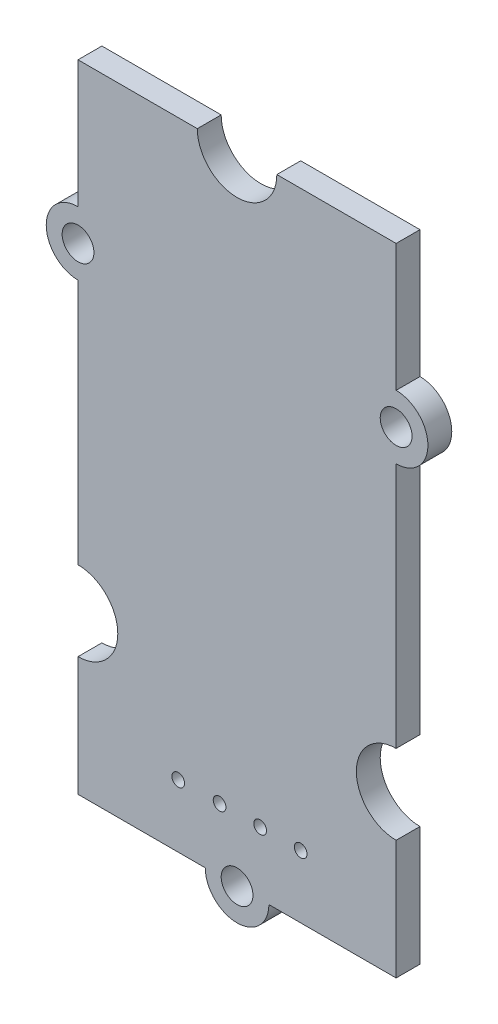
from build123d import *

# Parameters (mm, degrees)
PCB_DEPTH     = 1.5
ESQUISSE3_R   = 1
ESQUISSE3_R_2 = 0.4
TROUS_DEPTH   = 42.788156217


with BuildPart() as part:
    # Esquisse2 → PCB (new body)
    with BuildSketch(Plane.XY):
        with BuildLine():
            Line((-10, 0), (-2, 0))
            ThreePointArc((-2, 0), (0, -2), (2, 0))
            Line((2, 0), (10, 0))
            Line((10, 0), (10, 7.5))
            ThreePointArc((10, 7.5), (7.5, 10), (10, 12.5))
            Line((10, 12.5), (10, 28))
            ThreePointArc((10, 28), (12, 30), (10, 32))
            Line((10, 32), (10, 40))
            Line((10, 40), (2.5, 40))
            ThreePointArc((2.5, 40), (0, 37.5), (-2.5, 40))
            Line((-2.5, 40), (-10, 40))
            Line((-10, 40), (-10, 32))
            ThreePointArc((-10, 32), (-12, 30), (-10, 28))
            Line((-10, 28), (-10, 12.5))
            ThreePointArc((-10, 12.5), (-7.5, 10), (-10, 7.5))
            Line((-10, 7.5), (-10, 0))
        make_face()
    extrude(amount=PCB_DEPTH)

    # Esquisse3 → Trous (cut, through all)
    with BuildSketch(Plane.XY.offset(1.5)):
        with Locations((-10, 30)):
            Circle(ESQUISSE3_R)
        with Locations((4, 3.943417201)):
            Circle(ESQUISSE3_R_2)
        with Locations(Location((10, 30, 0), (0, 0, 180))):
            Circle(ESQUISSE3_R)
        Circle(ESQUISSE3_R)
        with Locations((1.45, 3.943417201)):
            Circle(ESQUISSE3_R_2)
        with Locations((-1.1, 3.943417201)):
            Circle(ESQUISSE3_R_2)
        with Locations((-3.7, 3.943417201)):
            Circle(ESQUISSE3_R_2)
    extrude(amount=-TROUS_DEPTH, mode=Mode.SUBTRACT)


solid = part.part
